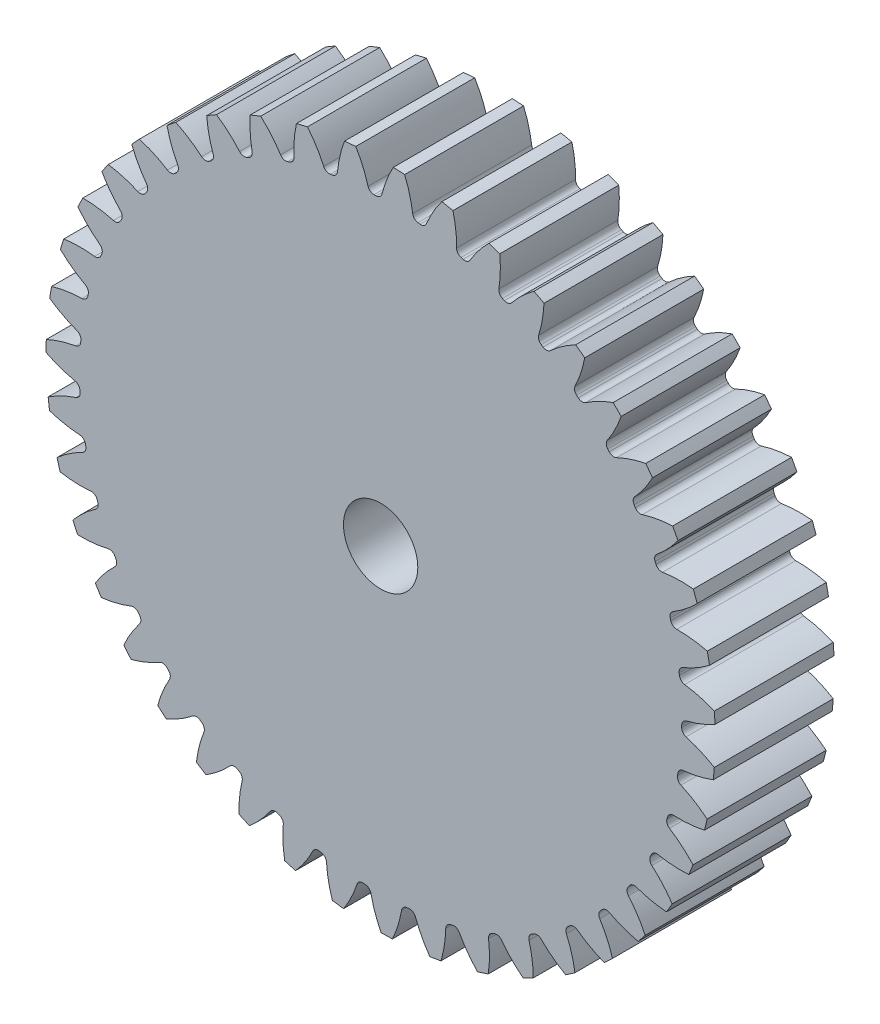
from build123d import *

# Parameters (mm, degrees)
SKETCH3_R         = 285.75
GEARBODY_DEPTH    = 101.6
TOOTHCUT_DEPTH    = 417.6877548
CIRPATTERN1_COUNT = 43
BOREDIA_R         = 31.75
BORE_DEPTH        = 12700


with BuildPart() as part:
    # Sketch3 → gearBody (new body)
    with BuildSketch(Plane.XY):
        Circle(SKETCH3_R)
    extrude(amount=GEARBODY_DEPTH)

    # Sketch2 → toothCut (cut, through all)
    with BuildSketch(Plane.XY):
        with BuildLine():
            ThreePointArc((257.113393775, -5.628797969), (257.132318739, -4.685219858), (257.147780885, -3.74157865))
            ThreePointArc((257.147780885, -3.74157865), (258.268747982, -0.601784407), (261.073485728, 1.200525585))
            ThreePointArc((261.073485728, 1.200525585), (273.736427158, 5.247869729), (285.75, 10.940421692))
            ThreePointArc((285.75, 10.940421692), (285.911901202, -5.209613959), (285.161761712, -21.343031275))
            ThreePointArc((285.161761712, -21.343031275), (273.363543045, -15.216603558), (260.856451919, -10.710635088))
            ThreePointArc((260.856451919, -10.710635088), (258.119234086, -8.807344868), (257.113393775, -5.628797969))
        make_face()
    toothcut = extrude(amount=TOOTHCUT_DEPTH, mode=Mode.SUBTRACT)

    # CirPattern1: toothCut ×43 about axis
    cirpattern1_axis = Axis((0, 0, 0), (0, 0, 1))
    for i in range(1, CIRPATTERN1_COUNT):
        add(toothcut.rotate(cirpattern1_axis, i * 360 / CIRPATTERN1_COUNT), mode=Mode.SUBTRACT)

    # boreDia → bore (cut, symmetric)
    with BuildSketch(Plane.XY):
        Circle(BOREDIA_R)
    extrude(amount=BORE_DEPTH, both=True, mode=Mode.SUBTRACT)


solid = part.part
